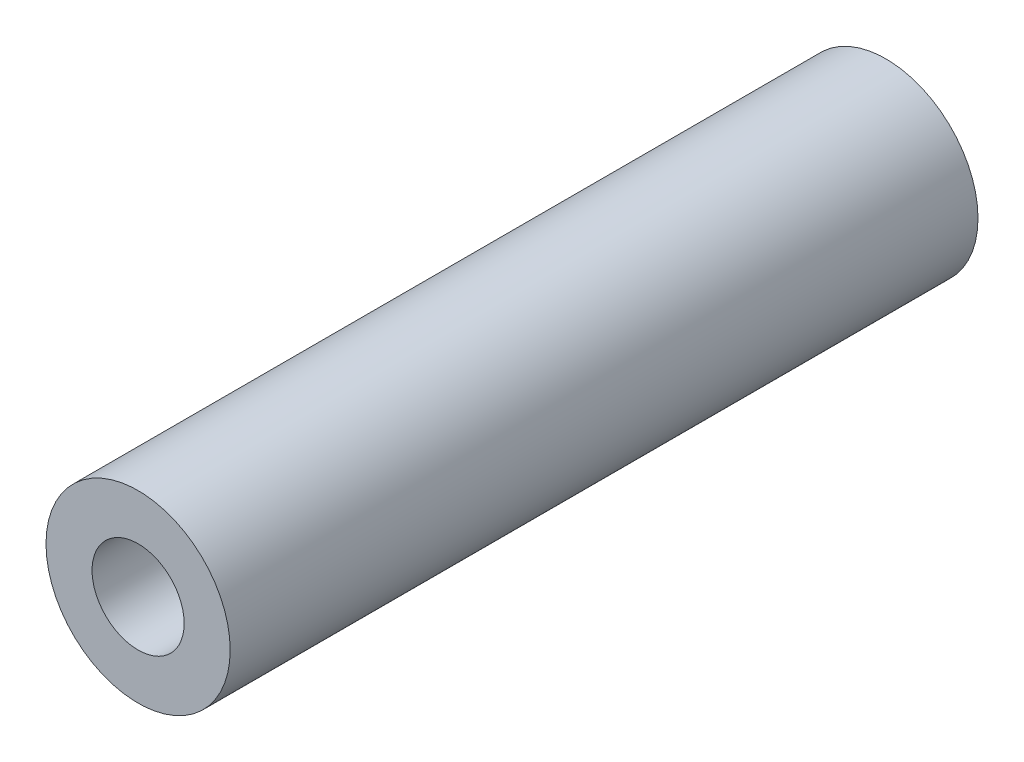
ISO-10303-21;
HEADER;
FILE_DESCRIPTION(('STEP AP214'),'2;1');
FILE_NAME('part.step','',(''),(''),'','','');
FILE_SCHEMA(('AUTOMOTIVE_DESIGN { 1 0 10303 214 1 1 1 1 }'));
ENDSEC;
DATA;
#1=APPLICATION_CONTEXT('core data for automotive mechanical design processes');
#2=APPLICATION_PROTOCOL_DEFINITION('international standard','automotive_design',2000,#1);
#3=PRODUCT_CONTEXT('',#1,'mechanical');
#4=PRODUCT('Part','Part','',(#3));
#5=PRODUCT_RELATED_PRODUCT_CATEGORY('part','',(#4));
#6=PRODUCT_DEFINITION_FORMATION('','',#4);
#7=PRODUCT_DEFINITION_CONTEXT('part definition',#1,'design');
#8=PRODUCT_DEFINITION('design','',#6,#7);
#9=PRODUCT_DEFINITION_SHAPE('','',#8);
#10=(LENGTH_UNIT() NAMED_UNIT(*) SI_UNIT(.MILLI.,.METRE.));
#11=(NAMED_UNIT(*) PLANE_ANGLE_UNIT() SI_UNIT($,.RADIAN.));
#12=(NAMED_UNIT(*) SI_UNIT($,.STERADIAN.) SOLID_ANGLE_UNIT());
#13=UNCERTAINTY_MEASURE_WITH_UNIT(LENGTH_MEASURE(1.E-05),#10,'distance_accuracy_value','');
#14=(GEOMETRIC_REPRESENTATION_CONTEXT(3) GLOBAL_UNCERTAINTY_ASSIGNED_CONTEXT((#13)) GLOBAL_UNIT_ASSIGNED_CONTEXT((#10,
#11,#12)) REPRESENTATION_CONTEXT('',''));
#15=CARTESIAN_POINT('',(0.,0.,0.));
#16=DIRECTION('',(0.,0.,1.));
#17=DIRECTION('',(1.,0.,0.));
#18=AXIS2_PLACEMENT_3D('',#15,#16,#17);
#19=CARTESIAN_POINT('',(0.,0.,203.));
#20=DIRECTION('',(0.,0.,1.));
#21=DIRECTION('',(1.,0.,0.));
#22=AXIS2_PLACEMENT_3D('',#19,#20,#21);
#23=PLANE('',#22);
#24=CARTESIAN_POINT('',(0.,0.,203.));
#25=DIRECTION('',(0.,0.,1.));
#26=DIRECTION('',(1.,0.,0.));
#27=AXIS2_PLACEMENT_3D('',#24,#25,#26);
#28=CIRCLE('',#27,25.);
#29=CARTESIAN_POINT('',(25.,0.,203.));
#30=VERTEX_POINT('',#29);
#31=EDGE_CURVE('E9',#30,#30,#28,.T.);
#32=ORIENTED_EDGE('',*,*,#31,.T.);
#33=EDGE_LOOP('',(#32));
#34=FACE_BOUND('',#33,.T.);
#35=CARTESIAN_POINT('',(0.,0.,203.));
#36=DIRECTION('',(0.,0.,1.));
#37=DIRECTION('',(1.,0.,0.));
#38=AXIS2_PLACEMENT_3D('',#35,#36,#37);
#39=CIRCLE('',#38,12.5);
#40=CARTESIAN_POINT('',(12.5,0.,203.));
#41=VERTEX_POINT('',#40);
#42=EDGE_CURVE('E25',#41,#41,#39,.T.);
#43=ORIENTED_EDGE('',*,*,#42,.F.);
#44=EDGE_LOOP('',(#43));
#45=FACE_BOUND('',#44,.T.);
#46=ADVANCED_FACE('F14',(#34,#45),#23,.T.);
#47=CARTESIAN_POINT('',(0.,0.,0.));
#48=DIRECTION('',(0.,0.,1.));
#49=DIRECTION('',(1.,0.,0.));
#50=AXIS2_PLACEMENT_3D('',#47,#48,#49);
#51=PLANE('',#50);
#52=CARTESIAN_POINT('',(0.,0.,0.));
#53=DIRECTION('',(0.,0.,1.));
#54=DIRECTION('',(1.,0.,0.));
#55=AXIS2_PLACEMENT_3D('',#52,#53,#54);
#56=CIRCLE('',#55,25.);
#57=CARTESIAN_POINT('',(25.,0.,0.));
#58=VERTEX_POINT('',#57);
#59=EDGE_CURVE('E18',#58,#58,#56,.T.);
#60=ORIENTED_EDGE('',*,*,#59,.F.);
#61=EDGE_LOOP('',(#60));
#62=FACE_BOUND('',#61,.T.);
#63=CARTESIAN_POINT('',(0.,0.,0.));
#64=DIRECTION('',(0.,0.,1.));
#65=DIRECTION('',(1.,0.,0.));
#66=AXIS2_PLACEMENT_3D('',#63,#64,#65);
#67=CIRCLE('',#66,12.5);
#68=CARTESIAN_POINT('',(12.5,0.,0.));
#69=VERTEX_POINT('',#68);
#70=EDGE_CURVE('E27',#69,#69,#67,.T.);
#71=ORIENTED_EDGE('',*,*,#70,.T.);
#72=EDGE_LOOP('',(#71));
#73=FACE_BOUND('',#72,.T.);
#74=ADVANCED_FACE('F37',(#62,#73),#51,.F.);
#75=CARTESIAN_POINT('',(0.,0.,203.));
#76=DIRECTION('',(0.,0.,-1.));
#77=DIRECTION('',(-1.,0.,0.));
#78=AXIS2_PLACEMENT_3D('',#75,#76,#77);
#79=CYLINDRICAL_SURFACE('',#78,25.);
#80=ORIENTED_EDGE('',*,*,#31,.F.);
#81=EDGE_LOOP('',(#80));
#82=FACE_BOUND('',#81,.T.);
#83=ORIENTED_EDGE('',*,*,#59,.T.);
#84=EDGE_LOOP('',(#83));
#85=FACE_BOUND('',#84,.T.);
#86=ADVANCED_FACE('F16',(#82,#85),#79,.T.);
#87=CARTESIAN_POINT('',(0.,0.,203.));
#88=DIRECTION('',(0.,0.,-1.));
#89=DIRECTION('',(-1.,0.,0.));
#90=AXIS2_PLACEMENT_3D('',#87,#88,#89);
#91=CYLINDRICAL_SURFACE('',#90,12.5);
#92=ORIENTED_EDGE('',*,*,#42,.T.);
#93=EDGE_LOOP('',(#92));
#94=FACE_BOUND('',#93,.T.);
#95=ORIENTED_EDGE('',*,*,#70,.F.);
#96=EDGE_LOOP('',(#95));
#97=FACE_BOUND('',#96,.T.);
#98=ADVANCED_FACE('F33',(#94,#97),#91,.F.);
#99=CLOSED_SHELL('',(#46,#74,#86,#98));
#100=MANIFOLD_SOLID_BREP('B1',#99);
#101=ADVANCED_BREP_SHAPE_REPRESENTATION('',(#18,#100),#14);
#102=SHAPE_DEFINITION_REPRESENTATION(#9,#101);
ENDSEC;
END-ISO-10303-21;
